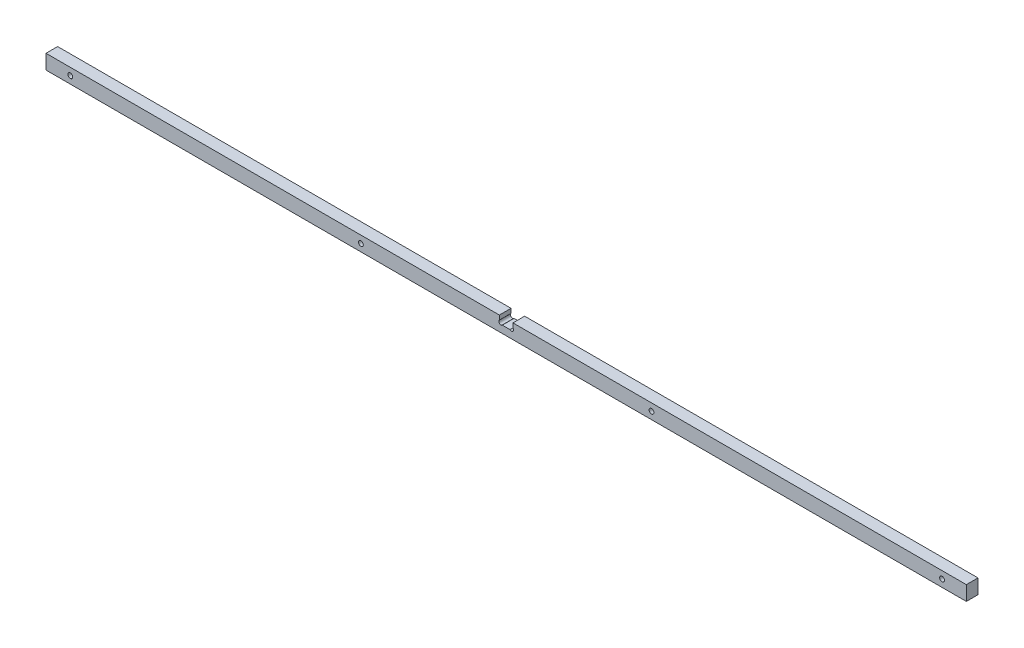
ISO-10303-21;
HEADER;
FILE_DESCRIPTION(('STEP AP214'),'2;1');
FILE_NAME('part.step','',(''),(''),'','','');
FILE_SCHEMA(('AUTOMOTIVE_DESIGN { 1 0 10303 214 1 1 1 1 }'));
ENDSEC;
DATA;
#1=APPLICATION_CONTEXT('core data for automotive mechanical design processes');
#2=APPLICATION_PROTOCOL_DEFINITION('international standard','automotive_design',2000,#1);
#3=PRODUCT_CONTEXT('',#1,'mechanical');
#4=PRODUCT('Part','Part','',(#3));
#5=PRODUCT_RELATED_PRODUCT_CATEGORY('part','',(#4));
#6=PRODUCT_DEFINITION_FORMATION('','',#4);
#7=PRODUCT_DEFINITION_CONTEXT('part definition',#1,'design');
#8=PRODUCT_DEFINITION('design','',#6,#7);
#9=PRODUCT_DEFINITION_SHAPE('','',#8);
#10=(LENGTH_UNIT() NAMED_UNIT(*) SI_UNIT(.MILLI.,.METRE.));
#11=(NAMED_UNIT(*) PLANE_ANGLE_UNIT() SI_UNIT($,.RADIAN.));
#12=(NAMED_UNIT(*) SI_UNIT($,.STERADIAN.) SOLID_ANGLE_UNIT());
#13=UNCERTAINTY_MEASURE_WITH_UNIT(LENGTH_MEASURE(1.E-05),#10,'distance_accuracy_value','');
#14=(GEOMETRIC_REPRESENTATION_CONTEXT(3) GLOBAL_UNCERTAINTY_ASSIGNED_CONTEXT((#13)) GLOBAL_UNIT_ASSIGNED_CONTEXT((#10,
#11,#12)) REPRESENTATION_CONTEXT('',''));
#15=CARTESIAN_POINT('',(0.,0.,0.));
#16=DIRECTION('',(0.,0.,1.));
#17=DIRECTION('',(1.,0.,0.));
#18=AXIS2_PLACEMENT_3D('',#15,#16,#17);
#19=CARTESIAN_POINT('',(-947.5,15.,24.));
#20=DIRECTION('',(0.,-1.,0.));
#21=DIRECTION('',(0.,0.,-1.));
#22=AXIS2_PLACEMENT_3D('',#19,#20,#21);
#23=PLANE('',#22);
#24=DIRECTION('',(-1.,0.,0.));
#25=VECTOR('',#24,1.);
#26=CARTESIAN_POINT('',(-947.5,15.,24.));
#27=LINE('',#26,#25);
#28=CARTESIAN_POINT('',(-14.,15.,24.));
#29=VERTEX_POINT('',#28);
#30=CARTESIAN_POINT('',(-947.5,15.,24.));
#31=VERTEX_POINT('',#30);
#32=EDGE_CURVE('E62',#29,#31,#27,.T.);
#33=ORIENTED_EDGE('',*,*,#32,.F.);
#34=DIRECTION('',(0.,0.,1.));
#35=VECTOR('',#34,1.);
#36=CARTESIAN_POINT('',(-14.,15.,0.));
#37=LINE('',#36,#35);
#38=CARTESIAN_POINT('',(-14.,15.,0.));
#39=VERTEX_POINT('',#38);
#40=EDGE_CURVE('E169',#39,#29,#37,.T.);
#41=ORIENTED_EDGE('',*,*,#40,.F.);
#42=DIRECTION('',(-1.,0.,0.));
#43=VECTOR('',#42,1.);
#44=CARTESIAN_POINT('',(-947.5,15.,0.));
#45=LINE('',#44,#43);
#46=CARTESIAN_POINT('',(-947.5,15.,0.));
#47=VERTEX_POINT('',#46);
#48=EDGE_CURVE('E84',#39,#47,#45,.T.);
#49=ORIENTED_EDGE('',*,*,#48,.T.);
#50=DIRECTION('',(0.,0.,-1.));
#51=VECTOR('',#50,1.);
#52=CARTESIAN_POINT('',(-947.5,15.,24.));
#53=LINE('',#52,#51);
#54=EDGE_CURVE('E222',#31,#47,#53,.T.);
#55=ORIENTED_EDGE('',*,*,#54,.F.);
#56=EDGE_LOOP('',(#33,#41,#49,#55));
#57=FACE_BOUND('',#56,.T.);
#58=ADVANCED_FACE('F38',(#57),#23,.F.);
#59=CARTESIAN_POINT('',(0.,0.,24.));
#60=DIRECTION('',(0.,0.,1.));
#61=DIRECTION('',(1.,0.,0.));
#62=AXIS2_PLACEMENT_3D('',#59,#60,#61);
#63=PLANE('',#62);
#64=DIRECTION('',(0.,-1.,0.));
#65=VECTOR('',#64,1.);
#66=CARTESIAN_POINT('',(-14.,15.,24.));
#67=LINE('',#66,#65);
#68=CARTESIAN_POINT('',(-14.,6.01039864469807,24.));
#69=VERTEX_POINT('',#68);
#70=EDGE_CURVE('E129',#29,#69,#67,.T.);
#71=ORIENTED_EDGE('',*,*,#70,.F.);
#72=ORIENTED_EDGE('',*,*,#32,.T.);
#73=DIRECTION('',(0.,-1.,0.));
#74=VECTOR('',#73,1.);
#75=CARTESIAN_POINT('',(-947.5,15.,24.));
#76=LINE('',#75,#74);
#77=CARTESIAN_POINT('',(-947.5,-15.0000000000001,24.));
#78=VERTEX_POINT('',#77);
#79=EDGE_CURVE('E210',#31,#78,#76,.T.);
#80=ORIENTED_EDGE('',*,*,#79,.T.);
#81=DIRECTION('',(1.,0.,0.));
#82=VECTOR('',#81,1.);
#83=CARTESIAN_POINT('',(-947.5,-15.0000000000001,24.));
#84=LINE('',#83,#82);
#85=CARTESIAN_POINT('',(947.5,-15.0000000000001,24.));
#86=VERTEX_POINT('',#85);
#87=EDGE_CURVE('E91',#78,#86,#84,.T.);
#88=ORIENTED_EDGE('',*,*,#87,.T.);
#89=DIRECTION('',(0.,1.,0.));
#90=VECTOR('',#89,1.);
#91=CARTESIAN_POINT('',(947.5,15.,24.));
#92=LINE('',#91,#90);
#93=CARTESIAN_POINT('',(947.5,15.,24.));
#94=VERTEX_POINT('',#93);
#95=EDGE_CURVE('E215',#86,#94,#92,.T.);
#96=ORIENTED_EDGE('',*,*,#95,.T.);
#97=CARTESIAN_POINT('',(14.,15.,24.));
#98=VERTEX_POINT('',#97);
#99=EDGE_CURVE('E218',#94,#98,#27,.T.);
#100=ORIENTED_EDGE('',*,*,#99,.T.);
#101=DIRECTION('',(0.,1.,0.));
#102=VECTOR('',#101,1.);
#103=CARTESIAN_POINT('',(14.,15.,24.));
#104=LINE('',#103,#102);
#105=CARTESIAN_POINT('',(14.,6.01039864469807,24.));
#106=VERTEX_POINT('',#105);
#107=EDGE_CURVE('E53',#106,#98,#104,.T.);
#108=ORIENTED_EDGE('',*,*,#107,.F.);
#109=CARTESIAN_POINT('',(11.,3.,24.));
#110=DIRECTION('',(0.,0.,1.));
#111=DIRECTION('',(1.,0.,0.));
#112=AXIS2_PLACEMENT_3D('',#109,#110,#111);
#113=CIRCLE('',#112,4.25);
#114=CARTESIAN_POINT('',(7.98960135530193,0.,24.));
#115=VERTEX_POINT('',#114);
#116=EDGE_CURVE('E152',#115,#106,#113,.T.);
#117=ORIENTED_EDGE('',*,*,#116,.F.);
#118=DIRECTION('',(1.,0.,0.));
#119=VECTOR('',#118,1.);
#120=CARTESIAN_POINT('',(-7.98960135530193,0.,24.));
#121=LINE('',#120,#119);
#122=CARTESIAN_POINT('',(-7.98960135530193,0.,24.));
#123=VERTEX_POINT('',#122);
#124=EDGE_CURVE('E164',#123,#115,#121,.T.);
#125=ORIENTED_EDGE('',*,*,#124,.F.);
#126=CARTESIAN_POINT('',(-11.,3.,24.));
#127=DIRECTION('',(0.,0.,1.));
#128=DIRECTION('',(1.,0.,0.));
#129=AXIS2_PLACEMENT_3D('',#126,#127,#128);
#130=CIRCLE('',#129,4.25);
#131=EDGE_CURVE('E162',#69,#123,#130,.T.);
#132=ORIENTED_EDGE('',*,*,#131,.F.);
#133=EDGE_LOOP('',(#71,#72,#80,#88,#96,#100,#108,#117,#125,#132));
#134=FACE_BOUND('',#133,.T.);
#135=CARTESIAN_POINT('',(-897.5,0.,24.));
#136=DIRECTION('',(0.,0.,1.));
#137=DIRECTION('',(1.,0.,0.));
#138=AXIS2_PLACEMENT_3D('',#135,#136,#137);
#139=CIRCLE('',#138,5.00000000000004);
#140=CARTESIAN_POINT('',(-892.5,0.,24.));
#141=VERTEX_POINT('',#140);
#142=EDGE_CURVE('E187',#141,#141,#139,.T.);
#143=ORIENTED_EDGE('',*,*,#142,.F.);
#144=EDGE_LOOP('',(#143));
#145=FACE_BOUND('',#144,.T.);
#146=CARTESIAN_POINT('',(299.166666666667,0.,24.));
#147=DIRECTION('',(0.,0.,1.));
#148=DIRECTION('',(1.,0.,0.));
#149=AXIS2_PLACEMENT_3D('',#146,#147,#148);
#150=CIRCLE('',#149,4.99999999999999);
#151=CARTESIAN_POINT('',(304.166666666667,0.,24.));
#152=VERTEX_POINT('',#151);
#153=EDGE_CURVE('E203',#152,#152,#150,.T.);
#154=ORIENTED_EDGE('',*,*,#153,.F.);
#155=EDGE_LOOP('',(#154));
#156=FACE_BOUND('',#155,.T.);
#157=CARTESIAN_POINT('',(897.5,0.,24.));
#158=DIRECTION('',(0.,0.,1.));
#159=DIRECTION('',(1.,0.,0.));
#160=AXIS2_PLACEMENT_3D('',#157,#158,#159);
#161=CIRCLE('',#160,5.00000000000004);
#162=CARTESIAN_POINT('',(902.5,0.,24.));
#163=VERTEX_POINT('',#162);
#164=EDGE_CURVE('E195',#163,#163,#161,.T.);
#165=ORIENTED_EDGE('',*,*,#164,.F.);
#166=EDGE_LOOP('',(#165));
#167=FACE_BOUND('',#166,.T.);
#168=CARTESIAN_POINT('',(-299.166666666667,0.,24.));
#169=DIRECTION('',(0.,0.,1.));
#170=DIRECTION('',(1.,0.,0.));
#171=AXIS2_PLACEMENT_3D('',#168,#169,#170);
#172=CIRCLE('',#171,4.99999999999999);
#173=CARTESIAN_POINT('',(-294.166666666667,0.,24.));
#174=VERTEX_POINT('',#173);
#175=EDGE_CURVE('E179',#174,#174,#172,.T.);
#176=ORIENTED_EDGE('',*,*,#175,.F.);
#177=EDGE_LOOP('',(#176));
#178=FACE_BOUND('',#177,.T.);
#179=ADVANCED_FACE('F250',(#134,#145,#156,#167,#178),#63,.T.);
#180=CARTESIAN_POINT('',(0.,0.,0.));
#181=DIRECTION('',(0.,0.,1.));
#182=DIRECTION('',(1.,0.,0.));
#183=AXIS2_PLACEMENT_3D('',#180,#181,#182);
#184=PLANE('',#183);
#185=ORIENTED_EDGE('',*,*,#48,.F.);
#186=DIRECTION('',(0.,-1.,0.));
#187=VECTOR('',#186,1.);
#188=CARTESIAN_POINT('',(-14.,15.,0.));
#189=LINE('',#188,#187);
#190=CARTESIAN_POINT('',(-14.,6.01039864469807,0.));
#191=VERTEX_POINT('',#190);
#192=EDGE_CURVE('E128',#39,#191,#189,.T.);
#193=ORIENTED_EDGE('',*,*,#192,.T.);
#194=CARTESIAN_POINT('',(-11.,3.,0.));
#195=DIRECTION('',(0.,0.,1.));
#196=DIRECTION('',(1.,0.,0.));
#197=AXIS2_PLACEMENT_3D('',#194,#195,#196);
#198=CIRCLE('',#197,4.25);
#199=CARTESIAN_POINT('',(-7.98960135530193,0.,0.));
#200=VERTEX_POINT('',#199);
#201=EDGE_CURVE('E137',#191,#200,#198,.T.);
#202=ORIENTED_EDGE('',*,*,#201,.T.);
#203=DIRECTION('',(1.,0.,0.));
#204=VECTOR('',#203,1.);
#205=CARTESIAN_POINT('',(-7.98960135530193,0.,0.));
#206=LINE('',#205,#204);
#207=CARTESIAN_POINT('',(7.98960135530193,0.,0.));
#208=VERTEX_POINT('',#207);
#209=EDGE_CURVE('E142',#200,#208,#206,.T.);
#210=ORIENTED_EDGE('',*,*,#209,.T.);
#211=CARTESIAN_POINT('',(11.,3.,0.));
#212=DIRECTION('',(0.,0.,1.));
#213=DIRECTION('',(1.,0.,0.));
#214=AXIS2_PLACEMENT_3D('',#211,#212,#213);
#215=CIRCLE('',#214,4.25);
#216=CARTESIAN_POINT('',(14.,6.01039864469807,0.));
#217=VERTEX_POINT('',#216);
#218=EDGE_CURVE('E156',#208,#217,#215,.T.);
#219=ORIENTED_EDGE('',*,*,#218,.T.);
#220=DIRECTION('',(0.,1.,0.));
#221=VECTOR('',#220,1.);
#222=CARTESIAN_POINT('',(14.,15.,0.));
#223=LINE('',#222,#221);
#224=CARTESIAN_POINT('',(14.,15.,0.));
#225=VERTEX_POINT('',#224);
#226=EDGE_CURVE('E134',#217,#225,#223,.T.);
#227=ORIENTED_EDGE('',*,*,#226,.T.);
#228=CARTESIAN_POINT('',(947.5,15.,0.));
#229=VERTEX_POINT('',#228);
#230=EDGE_CURVE('E212',#229,#225,#45,.T.);
#231=ORIENTED_EDGE('',*,*,#230,.F.);
#232=DIRECTION('',(0.,1.,0.));
#233=VECTOR('',#232,1.);
#234=CARTESIAN_POINT('',(947.5,15.,0.));
#235=LINE('',#234,#233);
#236=CARTESIAN_POINT('',(947.5,-15.0000000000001,0.));
#237=VERTEX_POINT('',#236);
#238=EDGE_CURVE('E229',#237,#229,#235,.T.);
#239=ORIENTED_EDGE('',*,*,#238,.F.);
#240=DIRECTION('',(1.,0.,0.));
#241=VECTOR('',#240,1.);
#242=CARTESIAN_POINT('',(-947.5,-15.0000000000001,0.));
#243=LINE('',#242,#241);
#244=CARTESIAN_POINT('',(-947.5,-15.0000000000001,0.));
#245=VERTEX_POINT('',#244);
#246=EDGE_CURVE('E226',#245,#237,#243,.T.);
#247=ORIENTED_EDGE('',*,*,#246,.F.);
#248=DIRECTION('',(0.,-1.,0.));
#249=VECTOR('',#248,1.);
#250=CARTESIAN_POINT('',(-947.5,15.,0.));
#251=LINE('',#250,#249);
#252=EDGE_CURVE('E207',#47,#245,#251,.T.);
#253=ORIENTED_EDGE('',*,*,#252,.F.);
#254=EDGE_LOOP('',(#185,#193,#202,#210,#219,#227,#231,#239,#247,#253));
#255=FACE_BOUND('',#254,.T.);
#256=CARTESIAN_POINT('',(299.166666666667,0.,0.));
#257=DIRECTION('',(0.,0.,1.));
#258=DIRECTION('',(1.,0.,0.));
#259=AXIS2_PLACEMENT_3D('',#256,#257,#258);
#260=CIRCLE('',#259,4.99999999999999);
#261=CARTESIAN_POINT('',(304.166666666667,0.,0.));
#262=VERTEX_POINT('',#261);
#263=EDGE_CURVE('E199',#262,#262,#260,.T.);
#264=ORIENTED_EDGE('',*,*,#263,.T.);
#265=EDGE_LOOP('',(#264));
#266=FACE_BOUND('',#265,.T.);
#267=CARTESIAN_POINT('',(897.5,0.,0.));
#268=DIRECTION('',(0.,0.,1.));
#269=DIRECTION('',(1.,0.,0.));
#270=AXIS2_PLACEMENT_3D('',#267,#268,#269);
#271=CIRCLE('',#270,5.00000000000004);
#272=CARTESIAN_POINT('',(902.5,0.,0.));
#273=VERTEX_POINT('',#272);
#274=EDGE_CURVE('E191',#273,#273,#271,.T.);
#275=ORIENTED_EDGE('',*,*,#274,.T.);
#276=EDGE_LOOP('',(#275));
#277=FACE_BOUND('',#276,.T.);
#278=CARTESIAN_POINT('',(-897.5,0.,0.));
#279=DIRECTION('',(0.,0.,1.));
#280=DIRECTION('',(1.,0.,0.));
#281=AXIS2_PLACEMENT_3D('',#278,#279,#280);
#282=CIRCLE('',#281,5.00000000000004);
#283=CARTESIAN_POINT('',(-892.5,0.,0.));
#284=VERTEX_POINT('',#283);
#285=EDGE_CURVE('E183',#284,#284,#282,.T.);
#286=ORIENTED_EDGE('',*,*,#285,.T.);
#287=EDGE_LOOP('',(#286));
#288=FACE_BOUND('',#287,.T.);
#289=CARTESIAN_POINT('',(-299.166666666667,0.,0.));
#290=DIRECTION('',(0.,0.,1.));
#291=DIRECTION('',(1.,0.,0.));
#292=AXIS2_PLACEMENT_3D('',#289,#290,#291);
#293=CIRCLE('',#292,4.99999999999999);
#294=CARTESIAN_POINT('',(-294.166666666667,0.,0.));
#295=VERTEX_POINT('',#294);
#296=EDGE_CURVE('E171',#295,#295,#293,.T.);
#297=ORIENTED_EDGE('',*,*,#296,.T.);
#298=EDGE_LOOP('',(#297));
#299=FACE_BOUND('',#298,.T.);
#300=ADVANCED_FACE('F144',(#255,#266,#277,#288,#299),#184,.F.);
#301=CARTESIAN_POINT('',(-947.5,15.,24.));
#302=DIRECTION('',(1.,0.,0.));
#303=DIRECTION('',(0.,0.,-1.));
#304=AXIS2_PLACEMENT_3D('',#301,#302,#303);
#305=PLANE('',#304);
#306=ORIENTED_EDGE('',*,*,#252,.T.);
#307=DIRECTION('',(0.,0.,-1.));
#308=VECTOR('',#307,1.);
#309=CARTESIAN_POINT('',(-947.5,-15.0000000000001,24.));
#310=LINE('',#309,#308);
#311=EDGE_CURVE('E11',#78,#245,#310,.T.);
#312=ORIENTED_EDGE('',*,*,#311,.F.);
#313=ORIENTED_EDGE('',*,*,#79,.F.);
#314=ORIENTED_EDGE('',*,*,#54,.T.);
#315=EDGE_LOOP('',(#306,#312,#313,#314));
#316=FACE_BOUND('',#315,.T.);
#317=ADVANCED_FACE('F40',(#316),#305,.F.);
#318=CARTESIAN_POINT('',(-947.5,-15.0000000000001,24.));
#319=DIRECTION('',(0.,1.,0.));
#320=DIRECTION('',(0.,0.,1.));
#321=AXIS2_PLACEMENT_3D('',#318,#319,#320);
#322=PLANE('',#321);
#323=ORIENTED_EDGE('',*,*,#246,.T.);
#324=DIRECTION('',(0.,0.,-1.));
#325=VECTOR('',#324,1.);
#326=CARTESIAN_POINT('',(947.5,-15.0000000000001,24.));
#327=LINE('',#326,#325);
#328=EDGE_CURVE('E46',#86,#237,#327,.T.);
#329=ORIENTED_EDGE('',*,*,#328,.F.);
#330=ORIENTED_EDGE('',*,*,#87,.F.);
#331=ORIENTED_EDGE('',*,*,#311,.T.);
#332=EDGE_LOOP('',(#323,#329,#330,#331));
#333=FACE_BOUND('',#332,.T.);
#334=ADVANCED_FACE('F256',(#333),#322,.F.);
#335=CARTESIAN_POINT('',(947.5,15.,24.));
#336=DIRECTION('',(-1.,0.,0.));
#337=DIRECTION('',(0.,0.,1.));
#338=AXIS2_PLACEMENT_3D('',#335,#336,#337);
#339=PLANE('',#338);
#340=ORIENTED_EDGE('',*,*,#238,.T.);
#341=DIRECTION('',(0.,0.,-1.));
#342=VECTOR('',#341,1.);
#343=CARTESIAN_POINT('',(947.5,15.,24.));
#344=LINE('',#343,#342);
#345=EDGE_CURVE('E237',#94,#229,#344,.T.);
#346=ORIENTED_EDGE('',*,*,#345,.F.);
#347=ORIENTED_EDGE('',*,*,#95,.F.);
#348=ORIENTED_EDGE('',*,*,#328,.T.);
#349=EDGE_LOOP('',(#340,#346,#347,#348));
#350=FACE_BOUND('',#349,.T.);
#351=ADVANCED_FACE('F243',(#350),#339,.F.);
#352=ORIENTED_EDGE('',*,*,#230,.T.);
#353=DIRECTION('',(0.,0.,1.));
#354=VECTOR('',#353,1.);
#355=CARTESIAN_POINT('',(14.,15.,0.));
#356=LINE('',#355,#354);
#357=EDGE_CURVE('E172',#225,#98,#356,.T.);
#358=ORIENTED_EDGE('',*,*,#357,.T.);
#359=ORIENTED_EDGE('',*,*,#99,.F.);
#360=ORIENTED_EDGE('',*,*,#345,.T.);
#361=EDGE_LOOP('',(#352,#358,#359,#360));
#362=FACE_BOUND('',#361,.T.);
#363=ADVANCED_FACE('F248',(#362),#23,.F.);
#364=CARTESIAN_POINT('',(299.166666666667,0.,24.));
#365=DIRECTION('',(0.,0.,-1.));
#366=DIRECTION('',(-1.,0.,0.));
#367=AXIS2_PLACEMENT_3D('',#364,#365,#366);
#368=CYLINDRICAL_SURFACE('',#367,4.99999999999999);
#369=ORIENTED_EDGE('',*,*,#153,.T.);
#370=EDGE_LOOP('',(#369));
#371=FACE_BOUND('',#370,.T.);
#372=ORIENTED_EDGE('',*,*,#263,.F.);
#373=EDGE_LOOP('',(#372));
#374=FACE_BOUND('',#373,.T.);
#375=ADVANCED_FACE('F271',(#371,#374),#368,.F.);
#376=CARTESIAN_POINT('',(897.5,0.,24.));
#377=DIRECTION('',(0.,0.,-1.));
#378=DIRECTION('',(-1.,0.,0.));
#379=AXIS2_PLACEMENT_3D('',#376,#377,#378);
#380=CYLINDRICAL_SURFACE('',#379,5.00000000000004);
#381=ORIENTED_EDGE('',*,*,#164,.T.);
#382=EDGE_LOOP('',(#381));
#383=FACE_BOUND('',#382,.T.);
#384=ORIENTED_EDGE('',*,*,#274,.F.);
#385=EDGE_LOOP('',(#384));
#386=FACE_BOUND('',#385,.T.);
#387=ADVANCED_FACE('F275',(#383,#386),#380,.F.);
#388=CARTESIAN_POINT('',(-897.5,0.,24.));
#389=DIRECTION('',(0.,0.,-1.));
#390=DIRECTION('',(-1.,0.,0.));
#391=AXIS2_PLACEMENT_3D('',#388,#389,#390);
#392=CYLINDRICAL_SURFACE('',#391,5.00000000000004);
#393=ORIENTED_EDGE('',*,*,#142,.T.);
#394=EDGE_LOOP('',(#393));
#395=FACE_BOUND('',#394,.T.);
#396=ORIENTED_EDGE('',*,*,#285,.F.);
#397=EDGE_LOOP('',(#396));
#398=FACE_BOUND('',#397,.T.);
#399=ADVANCED_FACE('F281',(#395,#398),#392,.F.);
#400=CARTESIAN_POINT('',(-299.166666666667,0.,24.));
#401=DIRECTION('',(0.,0.,-1.));
#402=DIRECTION('',(-1.,0.,0.));
#403=AXIS2_PLACEMENT_3D('',#400,#401,#402);
#404=CYLINDRICAL_SURFACE('',#403,4.99999999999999);
#405=ORIENTED_EDGE('',*,*,#175,.T.);
#406=EDGE_LOOP('',(#405));
#407=FACE_BOUND('',#406,.T.);
#408=ORIENTED_EDGE('',*,*,#296,.F.);
#409=EDGE_LOOP('',(#408));
#410=FACE_BOUND('',#409,.T.);
#411=ADVANCED_FACE('F301',(#407,#410),#404,.F.);
#412=CARTESIAN_POINT('',(-14.,15.,0.));
#413=DIRECTION('',(-1.,0.,0.));
#414=DIRECTION('',(0.,-1.,0.));
#415=AXIS2_PLACEMENT_3D('',#412,#413,#414);
#416=PLANE('',#415);
#417=ORIENTED_EDGE('',*,*,#70,.T.);
#418=DIRECTION('',(0.,0.,1.));
#419=VECTOR('',#418,1.);
#420=CARTESIAN_POINT('',(-14.,6.01039864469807,0.));
#421=LINE('',#420,#419);
#422=EDGE_CURVE('E124',#191,#69,#421,.T.);
#423=ORIENTED_EDGE('',*,*,#422,.F.);
#424=ORIENTED_EDGE('',*,*,#192,.F.);
#425=ORIENTED_EDGE('',*,*,#40,.T.);
#426=EDGE_LOOP('',(#417,#423,#424,#425));
#427=FACE_BOUND('',#426,.T.);
#428=ADVANCED_FACE('F126',(#427),#416,.F.);
#429=CARTESIAN_POINT('',(14.,15.,0.));
#430=DIRECTION('',(1.,0.,0.));
#431=DIRECTION('',(0.,1.,0.));
#432=AXIS2_PLACEMENT_3D('',#429,#430,#431);
#433=PLANE('',#432);
#434=ORIENTED_EDGE('',*,*,#107,.T.);
#435=ORIENTED_EDGE('',*,*,#357,.F.);
#436=ORIENTED_EDGE('',*,*,#226,.F.);
#437=DIRECTION('',(0.,0.,1.));
#438=VECTOR('',#437,1.);
#439=CARTESIAN_POINT('',(14.,6.01039864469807,0.));
#440=LINE('',#439,#438);
#441=EDGE_CURVE('E174',#217,#106,#440,.T.);
#442=ORIENTED_EDGE('',*,*,#441,.T.);
#443=EDGE_LOOP('',(#434,#435,#436,#442));
#444=FACE_BOUND('',#443,.T.);
#445=ADVANCED_FACE('F374',(#444),#433,.F.);
#446=CARTESIAN_POINT('',(11.,3.,0.));
#447=DIRECTION('',(0.,0.,1.));
#448=DIRECTION('',(1.,0.,0.));
#449=AXIS2_PLACEMENT_3D('',#446,#447,#448);
#450=CYLINDRICAL_SURFACE('',#449,4.25);
#451=ORIENTED_EDGE('',*,*,#116,.T.);
#452=ORIENTED_EDGE('',*,*,#441,.F.);
#453=ORIENTED_EDGE('',*,*,#218,.F.);
#454=DIRECTION('',(0.,0.,1.));
#455=VECTOR('',#454,1.);
#456=CARTESIAN_POINT('',(7.98960135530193,0.,0.));
#457=LINE('',#456,#455);
#458=EDGE_CURVE('E176',#208,#115,#457,.T.);
#459=ORIENTED_EDGE('',*,*,#458,.T.);
#460=EDGE_LOOP('',(#451,#452,#453,#459));
#461=FACE_BOUND('',#460,.T.);
#462=ADVANCED_FACE('F383',(#461),#450,.F.);
#463=CARTESIAN_POINT('',(-7.98960135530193,0.,0.));
#464=DIRECTION('',(0.,-1.,0.));
#465=DIRECTION('',(0.,0.,-1.));
#466=AXIS2_PLACEMENT_3D('',#463,#464,#465);
#467=PLANE('',#466);
#468=ORIENTED_EDGE('',*,*,#124,.T.);
#469=ORIENTED_EDGE('',*,*,#458,.F.);
#470=ORIENTED_EDGE('',*,*,#209,.F.);
#471=DIRECTION('',(0.,0.,1.));
#472=VECTOR('',#471,1.);
#473=CARTESIAN_POINT('',(-7.98960135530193,0.,0.));
#474=LINE('',#473,#472);
#475=EDGE_CURVE('E133',#200,#123,#474,.T.);
#476=ORIENTED_EDGE('',*,*,#475,.T.);
#477=EDGE_LOOP('',(#468,#469,#470,#476));
#478=FACE_BOUND('',#477,.T.);
#479=ADVANCED_FACE('F392',(#478),#467,.F.);
#480=CARTESIAN_POINT('',(-11.,3.,0.));
#481=DIRECTION('',(0.,0.,1.));
#482=DIRECTION('',(1.,0.,0.));
#483=AXIS2_PLACEMENT_3D('',#480,#481,#482);
#484=CYLINDRICAL_SURFACE('',#483,4.25);
#485=ORIENTED_EDGE('',*,*,#131,.T.);
#486=ORIENTED_EDGE('',*,*,#475,.F.);
#487=ORIENTED_EDGE('',*,*,#201,.F.);
#488=ORIENTED_EDGE('',*,*,#422,.T.);
#489=EDGE_LOOP('',(#485,#486,#487,#488));
#490=FACE_BOUND('',#489,.T.);
#491=ADVANCED_FACE('F138',(#490),#484,.F.);
#492=CLOSED_SHELL('',(#58,#179,#300,#317,#334,#351,#363,#375,#387,#399,#411,#428,#445,#462,#479,#491));
#493=MANIFOLD_SOLID_BREP('B2',#492);
#494=ADVANCED_BREP_SHAPE_REPRESENTATION('',(#18,#493),#14);
#495=SHAPE_DEFINITION_REPRESENTATION(#9,#494);
ENDSEC;
END-ISO-10303-21;
